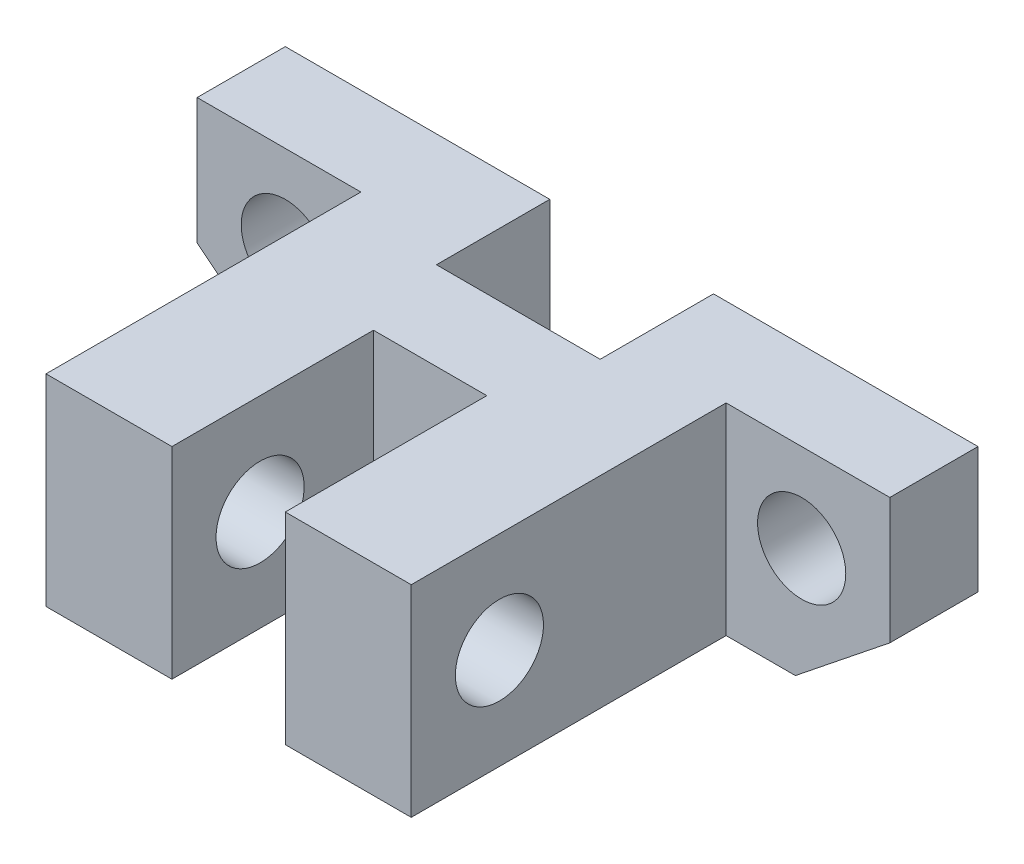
from build123d import *

# Parameters (mm, degrees)
SALIENTE_EXTRUIR1_DEPTH = 32
CROQUIS3_W              = 28.149246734
CROQUIS3_H              = 33.455515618
CORTAR_EXTRUIR1_DEPTH   = 13
CROQUIS4_W              = 32.272758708
CROQUIS4_H              = 29.27783323
CORTAR_EXTRUIR2_DEPTH   = 13
CROQUIS5_W              = 13
CROQUIS5_H              = 9
CORTAR_EXTRUIR3_DEPTH   = 46.124826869
CROQUIS6_W              = 9
CROQUIS6_H              = 23
CORTAR_EXTRUIR4_DEPTH   = 46.124826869
CROQUIS7_R              = 3.5
CORTAR_EXTRUIR5_DEPTH   = 54.935146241
CROQUIS9_R              = 3.5
CORTAR_EXTRUIR6_DEPTH   = 39.758869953


with BuildPart() as part:
    # Croquis1 → Saliente-Extruir1 (new body)
    with BuildSketch(Plane.XY):
        Polygon((-20, -11), (-27.5, -5), (-27.5, 5), (27.5, 5), (27.5, -5), (20, -11), align=None)
    extrude(amount=SALIENTE_EXTRUIR1_DEPTH)

    # Croquis3 → Cortar-Extruir1 (cut)
    with BuildSketch(Plane(origin=(27.5, 0, 0), x_dir=(0, 0, -1), z_dir=(1, 0, 0))):
        with Locations((-21.074623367, 0)):
            Rectangle(CROQUIS3_W, CROQUIS3_H)
    extrude(amount=-CORTAR_EXTRUIR1_DEPTH, mode=Mode.SUBTRACT)

    # Croquis4 → Cortar-Extruir2 (cut)
    with BuildSketch(Plane.ZY.offset(27.5)):
        with Locations((23.136379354, -3.846869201)):
            Rectangle(CROQUIS4_W, CROQUIS4_H)
    extrude(amount=-CORTAR_EXTRUIR2_DEPTH, mode=Mode.SUBTRACT)

    # Croquis5 → Cortar-Extruir3 (cut, through all)
    with BuildSketch(Plane.XZ.offset(11)):
        with Locations((0, 4.5)):
            Rectangle(CROQUIS5_W, CROQUIS5_H)
    extrude(amount=-CORTAR_EXTRUIR3_DEPTH, mode=Mode.SUBTRACT)

    # Croquis6 → Cortar-Extruir4 (cut, through all)
    with BuildSketch(Plane.XZ.offset(11)):
        with Locations((0, 27.5)):
            Rectangle(CROQUIS6_W, CROQUIS6_H)
    extrude(amount=-CORTAR_EXTRUIR4_DEPTH, mode=Mode.SUBTRACT)

    # Croquis7 → Cortar-Extruir5 (cut, through all)
    with BuildSketch(Plane(origin=(14.5, 0, 0), x_dir=(0, 0, -1), z_dir=(1, 0, 0))):
        with Locations(Location((-25, -3, 0), (0, 0, 180))):
            Circle(CROQUIS7_R)
    extrude(amount=-CORTAR_EXTRUIR5_DEPTH, mode=Mode.SUBTRACT)

    # Croquis9 → Cortar-Extruir6 (cut, through all)
    with BuildSketch(Plane.XY.offset(7)):
        with Locations((20.5, -2)):
            Circle(CROQUIS9_R)
        with Locations((-20.5, -2)):
            Circle(CROQUIS9_R)
    extrude(amount=-CORTAR_EXTRUIR6_DEPTH, mode=Mode.SUBTRACT)


solid = part.part
